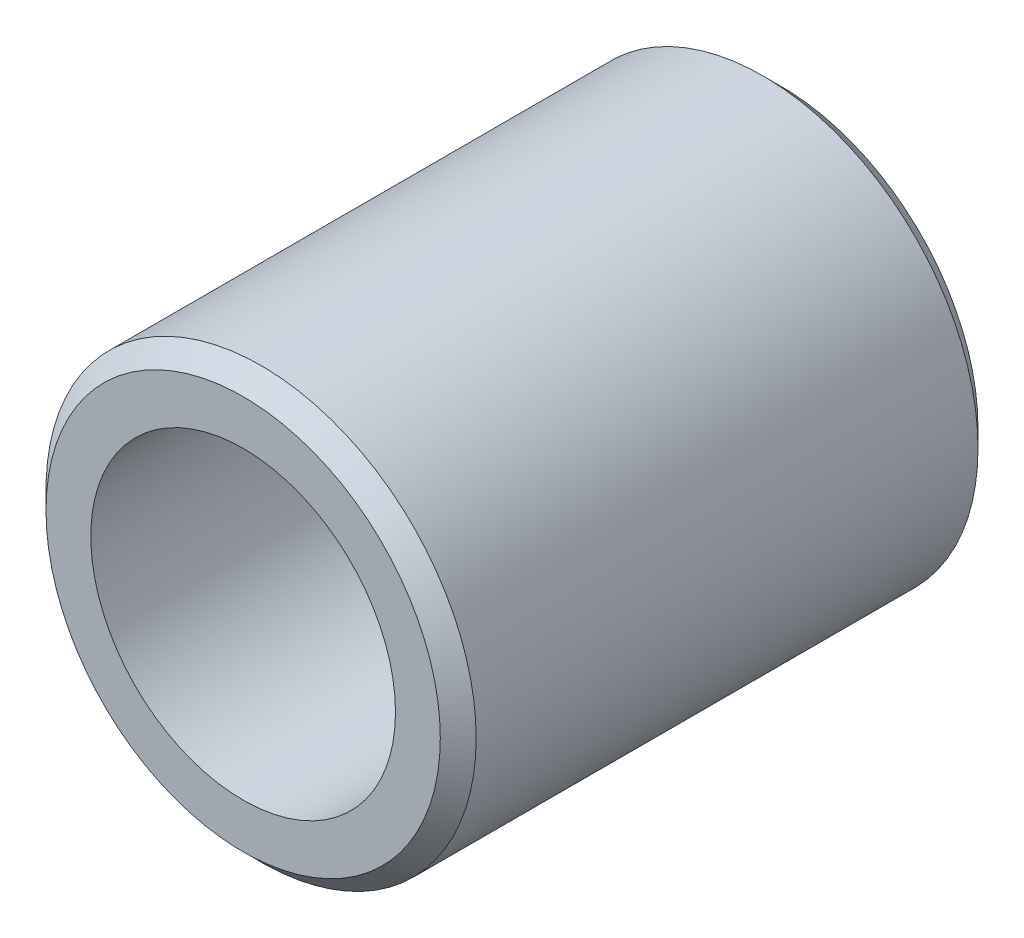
ISO-10303-21;
HEADER;
FILE_DESCRIPTION(('STEP AP214'),'2;1');
FILE_NAME('part.step','',(''),(''),'','','');
FILE_SCHEMA(('AUTOMOTIVE_DESIGN { 1 0 10303 214 1 1 1 1 }'));
ENDSEC;
DATA;
#1=APPLICATION_CONTEXT('core data for automotive mechanical design processes');
#2=APPLICATION_PROTOCOL_DEFINITION('international standard','automotive_design',2000,#1);
#3=PRODUCT_CONTEXT('',#1,'mechanical');
#4=PRODUCT('Part','Part','',(#3));
#5=PRODUCT_RELATED_PRODUCT_CATEGORY('part','',(#4));
#6=PRODUCT_DEFINITION_FORMATION('','',#4);
#7=PRODUCT_DEFINITION_CONTEXT('part definition',#1,'design');
#8=PRODUCT_DEFINITION('design','',#6,#7);
#9=PRODUCT_DEFINITION_SHAPE('','',#8);
#10=(LENGTH_UNIT() NAMED_UNIT(*) SI_UNIT(.MILLI.,.METRE.));
#11=(NAMED_UNIT(*) PLANE_ANGLE_UNIT() SI_UNIT($,.RADIAN.));
#12=(NAMED_UNIT(*) SI_UNIT($,.STERADIAN.) SOLID_ANGLE_UNIT());
#13=UNCERTAINTY_MEASURE_WITH_UNIT(LENGTH_MEASURE(1.E-05),#10,'distance_accuracy_value','');
#14=(GEOMETRIC_REPRESENTATION_CONTEXT(3) GLOBAL_UNCERTAINTY_ASSIGNED_CONTEXT((#13)) GLOBAL_UNIT_ASSIGNED_CONTEXT((#10,
#11,#12)) REPRESENTATION_CONTEXT('',''));
#15=CARTESIAN_POINT('',(0.,0.,0.));
#16=DIRECTION('',(0.,0.,1.));
#17=DIRECTION('',(1.,0.,0.));
#18=AXIS2_PLACEMENT_3D('',#15,#16,#17);
#19=CARTESIAN_POINT('',(0.,0.,15.));
#20=DIRECTION('',(0.,0.,1.));
#21=DIRECTION('',(1.,0.,0.));
#22=AXIS2_PLACEMENT_3D('',#19,#20,#21);
#23=PLANE('',#22);
#24=CARTESIAN_POINT('',(0.,0.,15.));
#25=DIRECTION('',(0.,0.,1.));
#26=DIRECTION('',(1.,0.,0.));
#27=AXIS2_PLACEMENT_3D('',#24,#25,#26);
#28=CIRCLE('',#27,5.5);
#29=CARTESIAN_POINT('',(5.5,0.,15.));
#30=VERTEX_POINT('',#29);
#31=EDGE_CURVE('E46',#30,#30,#28,.T.);
#32=ORIENTED_EDGE('',*,*,#31,.T.);
#33=EDGE_LOOP('',(#32));
#34=FACE_BOUND('',#33,.T.);
#35=CARTESIAN_POINT('',(0.,0.,15.));
#36=DIRECTION('',(0.,0.,1.));
#37=DIRECTION('',(1.,0.,0.));
#38=AXIS2_PLACEMENT_3D('',#35,#36,#37);
#39=CIRCLE('',#38,4.25);
#40=CARTESIAN_POINT('',(4.25,0.,15.));
#41=VERTEX_POINT('',#40);
#42=EDGE_CURVE('E51',#41,#41,#39,.T.);
#43=ORIENTED_EDGE('',*,*,#42,.F.);
#44=EDGE_LOOP('',(#43));
#45=FACE_BOUND('',#44,.T.);
#46=ADVANCED_FACE('F31',(#34,#45),#23,.T.);
#47=CARTESIAN_POINT('',(0.,0.,0.));
#48=DIRECTION('',(0.,0.,1.));
#49=DIRECTION('',(1.,0.,0.));
#50=AXIS2_PLACEMENT_3D('',#47,#48,#49);
#51=PLANE('',#50);
#52=CARTESIAN_POINT('',(0.,0.,0.));
#53=DIRECTION('',(0.,0.,1.));
#54=DIRECTION('',(1.,0.,0.));
#55=AXIS2_PLACEMENT_3D('',#52,#53,#54);
#56=CIRCLE('',#55,5.5);
#57=CARTESIAN_POINT('',(5.5,0.,0.));
#58=VERTEX_POINT('',#57);
#59=EDGE_CURVE('E10',#58,#58,#56,.F.);
#60=ORIENTED_EDGE('',*,*,#59,.T.);
#61=EDGE_LOOP('',(#60));
#62=FACE_BOUND('',#61,.T.);
#63=CARTESIAN_POINT('',(0.,0.,0.));
#64=DIRECTION('',(0.,0.,1.));
#65=DIRECTION('',(1.,0.,0.));
#66=AXIS2_PLACEMENT_3D('',#63,#64,#65);
#67=CIRCLE('',#66,4.25);
#68=CARTESIAN_POINT('',(4.25,0.,0.));
#69=VERTEX_POINT('',#68);
#70=EDGE_CURVE('E52',#69,#69,#67,.T.);
#71=ORIENTED_EDGE('',*,*,#70,.T.);
#72=EDGE_LOOP('',(#71));
#73=FACE_BOUND('',#72,.T.);
#74=ADVANCED_FACE('F62',(#62,#73),#51,.F.);
#75=CARTESIAN_POINT('',(0.,0.,15.));
#76=DIRECTION('',(0.,0.,-1.));
#77=DIRECTION('',(-1.,0.,0.));
#78=AXIS2_PLACEMENT_3D('',#75,#76,#77);
#79=CYLINDRICAL_SURFACE('',#78,6.);
#80=CARTESIAN_POINT('',(0.,0.,14.5));
#81=DIRECTION('',(0.,0.,1.));
#82=DIRECTION('',(1.,0.,0.));
#83=AXIS2_PLACEMENT_3D('',#80,#81,#82);
#84=CIRCLE('',#83,6.);
#85=CARTESIAN_POINT('',(6.,0.,14.5));
#86=VERTEX_POINT('',#85);
#87=EDGE_CURVE('E38',#86,#86,#84,.F.);
#88=ORIENTED_EDGE('',*,*,#87,.T.);
#89=EDGE_LOOP('',(#88));
#90=FACE_BOUND('',#89,.T.);
#91=CARTESIAN_POINT('',(0.,0.,0.499999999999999));
#92=DIRECTION('',(0.,0.,1.));
#93=DIRECTION('',(1.,0.,0.));
#94=AXIS2_PLACEMENT_3D('',#91,#92,#93);
#95=CIRCLE('',#94,6.);
#96=CARTESIAN_POINT('',(6.,0.,0.499999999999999));
#97=VERTEX_POINT('',#96);
#98=EDGE_CURVE('E42',#97,#97,#95,.T.);
#99=ORIENTED_EDGE('',*,*,#98,.T.);
#100=EDGE_LOOP('',(#99));
#101=FACE_BOUND('',#100,.T.);
#102=ADVANCED_FACE('F68',(#90,#101),#79,.T.);
#103=CARTESIAN_POINT('',(0.,0.,15.));
#104=DIRECTION('',(0.,0.,-1.));
#105=DIRECTION('',(-1.,0.,0.));
#106=AXIS2_PLACEMENT_3D('',#103,#104,#105);
#107=CYLINDRICAL_SURFACE('',#106,4.25);
#108=ORIENTED_EDGE('',*,*,#42,.T.);
#109=EDGE_LOOP('',(#108));
#110=FACE_BOUND('',#109,.T.);
#111=ORIENTED_EDGE('',*,*,#70,.F.);
#112=EDGE_LOOP('',(#111));
#113=FACE_BOUND('',#112,.T.);
#114=ADVANCED_FACE('F58',(#110,#113),#107,.F.);
#115=CARTESIAN_POINT('',(0.,0.,15.));
#116=DIRECTION('',(0.,0.,-1.));
#117=DIRECTION('',(-1.,0.,0.));
#118=AXIS2_PLACEMENT_3D('',#115,#116,#117);
#119=CONICAL_SURFACE('',#118,5.5,0.785398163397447);
#120=ORIENTED_EDGE('',*,*,#87,.F.);
#121=EDGE_LOOP('',(#120));
#122=FACE_BOUND('',#121,.T.);
#123=ORIENTED_EDGE('',*,*,#31,.F.);
#124=EDGE_LOOP('',(#123));
#125=FACE_BOUND('',#124,.T.);
#126=ADVANCED_FACE('F73',(#122,#125),#119,.T.);
#127=CARTESIAN_POINT('',(0.,0.,0.499999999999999));
#128=DIRECTION('',(0.,0.,1.));
#129=DIRECTION('',(1.,0.,0.));
#130=AXIS2_PLACEMENT_3D('',#127,#128,#129);
#131=CONICAL_SURFACE('',#130,6.,0.785398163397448);
#132=ORIENTED_EDGE('',*,*,#59,.F.);
#133=EDGE_LOOP('',(#132));
#134=FACE_BOUND('',#133,.T.);
#135=ORIENTED_EDGE('',*,*,#98,.F.);
#136=EDGE_LOOP('',(#135));
#137=FACE_BOUND('',#136,.T.);
#138=ADVANCED_FACE('F33',(#134,#137),#131,.T.);
#139=CLOSED_SHELL('',(#46,#74,#102,#114,#126,#138));
#140=MANIFOLD_SOLID_BREP('B2',#139);
#141=ADVANCED_BREP_SHAPE_REPRESENTATION('',(#18,#140),#14);
#142=SHAPE_DEFINITION_REPRESENTATION(#9,#141);
ENDSEC;
END-ISO-10303-21;
